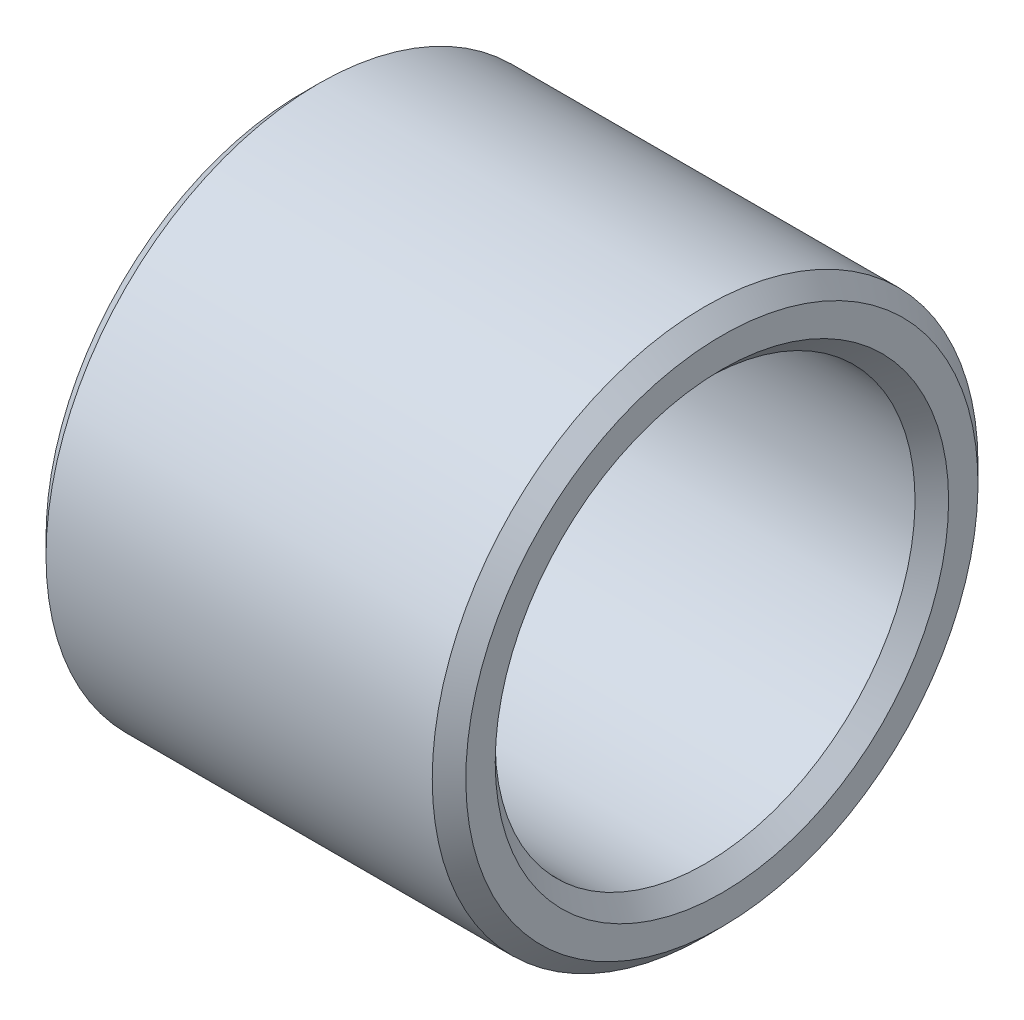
ISO-10303-21;
HEADER;
FILE_DESCRIPTION(('STEP AP214'),'2;1');
FILE_NAME('part.step','',(''),(''),'','','');
FILE_SCHEMA(('AUTOMOTIVE_DESIGN { 1 0 10303 214 1 1 1 1 }'));
ENDSEC;
DATA;
#1=APPLICATION_CONTEXT('core data for automotive mechanical design processes');
#2=APPLICATION_PROTOCOL_DEFINITION('international standard','automotive_design',2000,#1);
#3=PRODUCT_CONTEXT('',#1,'mechanical');
#4=PRODUCT('Part','Part','',(#3));
#5=PRODUCT_RELATED_PRODUCT_CATEGORY('part','',(#4));
#6=PRODUCT_DEFINITION_FORMATION('','',#4);
#7=PRODUCT_DEFINITION_CONTEXT('part definition',#1,'design');
#8=PRODUCT_DEFINITION('design','',#6,#7);
#9=PRODUCT_DEFINITION_SHAPE('','',#8);
#10=(LENGTH_UNIT() NAMED_UNIT(*) SI_UNIT(.MILLI.,.METRE.));
#11=(NAMED_UNIT(*) PLANE_ANGLE_UNIT() SI_UNIT($,.RADIAN.));
#12=(NAMED_UNIT(*) SI_UNIT($,.STERADIAN.) SOLID_ANGLE_UNIT());
#13=UNCERTAINTY_MEASURE_WITH_UNIT(LENGTH_MEASURE(1.E-05),#10,'distance_accuracy_value','');
#14=(GEOMETRIC_REPRESENTATION_CONTEXT(3) GLOBAL_UNCERTAINTY_ASSIGNED_CONTEXT((#13)) GLOBAL_UNIT_ASSIGNED_CONTEXT((#10,
#11,#12)) REPRESENTATION_CONTEXT('',''));
#15=CARTESIAN_POINT('',(0.,0.,0.));
#16=DIRECTION('',(0.,0.,1.));
#17=DIRECTION('',(1.,0.,0.));
#18=AXIS2_PLACEMENT_3D('',#15,#16,#17);
#19=CARTESIAN_POINT('',(0.,-5.75,0.));
#20=DIRECTION('',(-1.,0.,0.));
#21=DIRECTION('',(0.,1.,0.));
#22=AXIS2_PLACEMENT_3D('',#19,#20,#21);
#23=PLANE('',#22);
#24=CARTESIAN_POINT('',(0.,0.,0.));
#25=DIRECTION('',(1.,0.,0.));
#26=DIRECTION('',(0.,-1.,0.));
#27=AXIS2_PLACEMENT_3D('',#24,#25,#26);
#28=CIRCLE('',#27,5.4);
#29=CARTESIAN_POINT('',(0.,-5.4,0.));
#30=VERTEX_POINT('',#29);
#31=EDGE_CURVE('E9',#30,#30,#28,.T.);
#32=ORIENTED_EDGE('',*,*,#31,.T.);
#33=EDGE_LOOP('',(#32));
#34=FACE_BOUND('',#33,.T.);
#35=CARTESIAN_POINT('',(0.,0.,0.));
#36=DIRECTION('',(1.,0.,0.));
#37=DIRECTION('',(0.,-1.,0.));
#38=AXIS2_PLACEMENT_3D('',#35,#36,#37);
#39=CIRCLE('',#38,6.1);
#40=CARTESIAN_POINT('',(0.,-6.1,0.));
#41=VERTEX_POINT('',#40);
#42=EDGE_CURVE('E44',#41,#41,#39,.T.);
#43=ORIENTED_EDGE('',*,*,#42,.F.);
#44=EDGE_LOOP('',(#43));
#45=FACE_BOUND('',#44,.T.);
#46=ADVANCED_FACE('F15',(#34,#45),#23,.T.);
#47=CARTESIAN_POINT('',(0.2,0.,0.));
#48=DIRECTION('',(-1.,0.,0.));
#49=DIRECTION('',(0.,-1.,0.));
#50=AXIS2_PLACEMENT_3D('',#47,#48,#49);
#51=CONICAL_SURFACE('',#50,5.2,0.785398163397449);
#52=CARTESIAN_POINT('',(0.4,0.,0.));
#53=DIRECTION('',(1.,0.,0.));
#54=DIRECTION('',(0.,-1.,0.));
#55=AXIS2_PLACEMENT_3D('',#52,#53,#54);
#56=CIRCLE('',#55,5.);
#57=CARTESIAN_POINT('',(0.4,-5.,0.));
#58=VERTEX_POINT('',#57);
#59=EDGE_CURVE('E25',#58,#58,#56,.T.);
#60=ORIENTED_EDGE('',*,*,#59,.T.);
#61=EDGE_LOOP('',(#60));
#62=FACE_BOUND('',#61,.T.);
#63=ORIENTED_EDGE('',*,*,#31,.F.);
#64=EDGE_LOOP('',(#63));
#65=FACE_BOUND('',#64,.T.);
#66=ADVANCED_FACE('F86',(#62,#65),#51,.F.);
#67=CARTESIAN_POINT('',(5.,0.,0.));
#68=DIRECTION('',(-1.,0.,0.));
#69=DIRECTION('',(0.,-1.,0.));
#70=AXIS2_PLACEMENT_3D('',#67,#68,#69);
#71=CYLINDRICAL_SURFACE('',#70,5.);
#72=CARTESIAN_POINT('',(9.6,0.,0.));
#73=DIRECTION('',(1.,0.,0.));
#74=DIRECTION('',(0.,-1.,0.));
#75=AXIS2_PLACEMENT_3D('',#72,#73,#74);
#76=CIRCLE('',#75,5.);
#77=CARTESIAN_POINT('',(9.6,-5.,0.));
#78=VERTEX_POINT('',#77);
#79=EDGE_CURVE('E19',#78,#78,#76,.T.);
#80=ORIENTED_EDGE('',*,*,#79,.T.);
#81=EDGE_LOOP('',(#80));
#82=FACE_BOUND('',#81,.T.);
#83=ORIENTED_EDGE('',*,*,#59,.F.);
#84=EDGE_LOOP('',(#83));
#85=FACE_BOUND('',#84,.T.);
#86=ADVANCED_FACE('F17',(#82,#85),#71,.F.);
#87=CARTESIAN_POINT('',(9.8,0.,0.));
#88=DIRECTION('',(1.,0.,0.));
#89=DIRECTION('',(0.,-1.,0.));
#90=AXIS2_PLACEMENT_3D('',#87,#88,#89);
#91=CONICAL_SURFACE('',#90,5.2,0.785398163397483);
#92=CARTESIAN_POINT('',(10.,0.,0.));
#93=DIRECTION('',(1.,0.,0.));
#94=DIRECTION('',(0.,-1.,0.));
#95=AXIS2_PLACEMENT_3D('',#92,#93,#94);
#96=CIRCLE('',#95,5.4);
#97=CARTESIAN_POINT('',(10.,-5.4,0.));
#98=VERTEX_POINT('',#97);
#99=EDGE_CURVE('E62',#98,#98,#96,.T.);
#100=ORIENTED_EDGE('',*,*,#99,.T.);
#101=EDGE_LOOP('',(#100));
#102=FACE_BOUND('',#101,.T.);
#103=ORIENTED_EDGE('',*,*,#79,.F.);
#104=EDGE_LOOP('',(#103));
#105=FACE_BOUND('',#104,.T.);
#106=ADVANCED_FACE('F93',(#102,#105),#91,.F.);
#107=CARTESIAN_POINT('',(10.,-5.75,0.));
#108=DIRECTION('',(1.,0.,0.));
#109=DIRECTION('',(0.,-1.,0.));
#110=AXIS2_PLACEMENT_3D('',#107,#108,#109);
#111=PLANE('',#110);
#112=CARTESIAN_POINT('',(10.,0.,0.));
#113=DIRECTION('',(1.,0.,0.));
#114=DIRECTION('',(0.,-1.,0.));
#115=AXIS2_PLACEMENT_3D('',#112,#113,#114);
#116=CIRCLE('',#115,6.1);
#117=CARTESIAN_POINT('',(10.,-6.1,0.));
#118=VERTEX_POINT('',#117);
#119=EDGE_CURVE('E57',#118,#118,#116,.T.);
#120=ORIENTED_EDGE('',*,*,#119,.T.);
#121=EDGE_LOOP('',(#120));
#122=FACE_BOUND('',#121,.T.);
#123=ORIENTED_EDGE('',*,*,#99,.F.);
#124=EDGE_LOOP('',(#123));
#125=FACE_BOUND('',#124,.T.);
#126=ADVANCED_FACE('F82',(#122,#125),#111,.T.);
#127=CARTESIAN_POINT('',(9.8,0.,0.));
#128=DIRECTION('',(-1.,0.,0.));
#129=DIRECTION('',(0.,-1.,0.));
#130=AXIS2_PLACEMENT_3D('',#127,#128,#129);
#131=CONICAL_SURFACE('',#130,6.3,0.785398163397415);
#132=CARTESIAN_POINT('',(9.6,0.,0.));
#133=DIRECTION('',(1.,0.,0.));
#134=DIRECTION('',(0.,-1.,0.));
#135=AXIS2_PLACEMENT_3D('',#132,#133,#134);
#136=CIRCLE('',#135,6.5);
#137=CARTESIAN_POINT('',(9.6,-6.5,0.));
#138=VERTEX_POINT('',#137);
#139=EDGE_CURVE('E54',#138,#138,#136,.T.);
#140=ORIENTED_EDGE('',*,*,#139,.T.);
#141=EDGE_LOOP('',(#140));
#142=FACE_BOUND('',#141,.T.);
#143=ORIENTED_EDGE('',*,*,#119,.F.);
#144=EDGE_LOOP('',(#143));
#145=FACE_BOUND('',#144,.T.);
#146=ADVANCED_FACE('F71',(#142,#145),#131,.T.);
#147=CARTESIAN_POINT('',(5.,0.,0.));
#148=DIRECTION('',(-1.,0.,0.));
#149=DIRECTION('',(0.,-1.,0.));
#150=AXIS2_PLACEMENT_3D('',#147,#148,#149);
#151=CYLINDRICAL_SURFACE('',#150,6.5);
#152=CARTESIAN_POINT('',(0.4,0.,0.));
#153=DIRECTION('',(1.,0.,0.));
#154=DIRECTION('',(0.,-1.,0.));
#155=AXIS2_PLACEMENT_3D('',#152,#153,#154);
#156=CIRCLE('',#155,6.5);
#157=CARTESIAN_POINT('',(0.4,-6.5,0.));
#158=VERTEX_POINT('',#157);
#159=EDGE_CURVE('E49',#158,#158,#156,.T.);
#160=ORIENTED_EDGE('',*,*,#159,.T.);
#161=EDGE_LOOP('',(#160));
#162=FACE_BOUND('',#161,.T.);
#163=ORIENTED_EDGE('',*,*,#139,.F.);
#164=EDGE_LOOP('',(#163));
#165=FACE_BOUND('',#164,.T.);
#166=ADVANCED_FACE('F50',(#162,#165),#151,.T.);
#167=CARTESIAN_POINT('',(0.2,0.,0.));
#168=DIRECTION('',(1.,0.,0.));
#169=DIRECTION('',(0.,-1.,0.));
#170=AXIS2_PLACEMENT_3D('',#167,#168,#169);
#171=CONICAL_SURFACE('',#170,6.3,0.785398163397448);
#172=ORIENTED_EDGE('',*,*,#42,.T.);
#173=EDGE_LOOP('',(#172));
#174=FACE_BOUND('',#173,.T.);
#175=ORIENTED_EDGE('',*,*,#159,.F.);
#176=EDGE_LOOP('',(#175));
#177=FACE_BOUND('',#176,.T.);
#178=ADVANCED_FACE('F74',(#174,#177),#171,.T.);
#179=CLOSED_SHELL('',(#46,#66,#86,#106,#126,#146,#166,#178));
#180=MANIFOLD_SOLID_BREP('B1',#179);
#181=ADVANCED_BREP_SHAPE_REPRESENTATION('',(#18,#180),#14);
#182=SHAPE_DEFINITION_REPRESENTATION(#9,#181);
ENDSEC;
END-ISO-10303-21;
